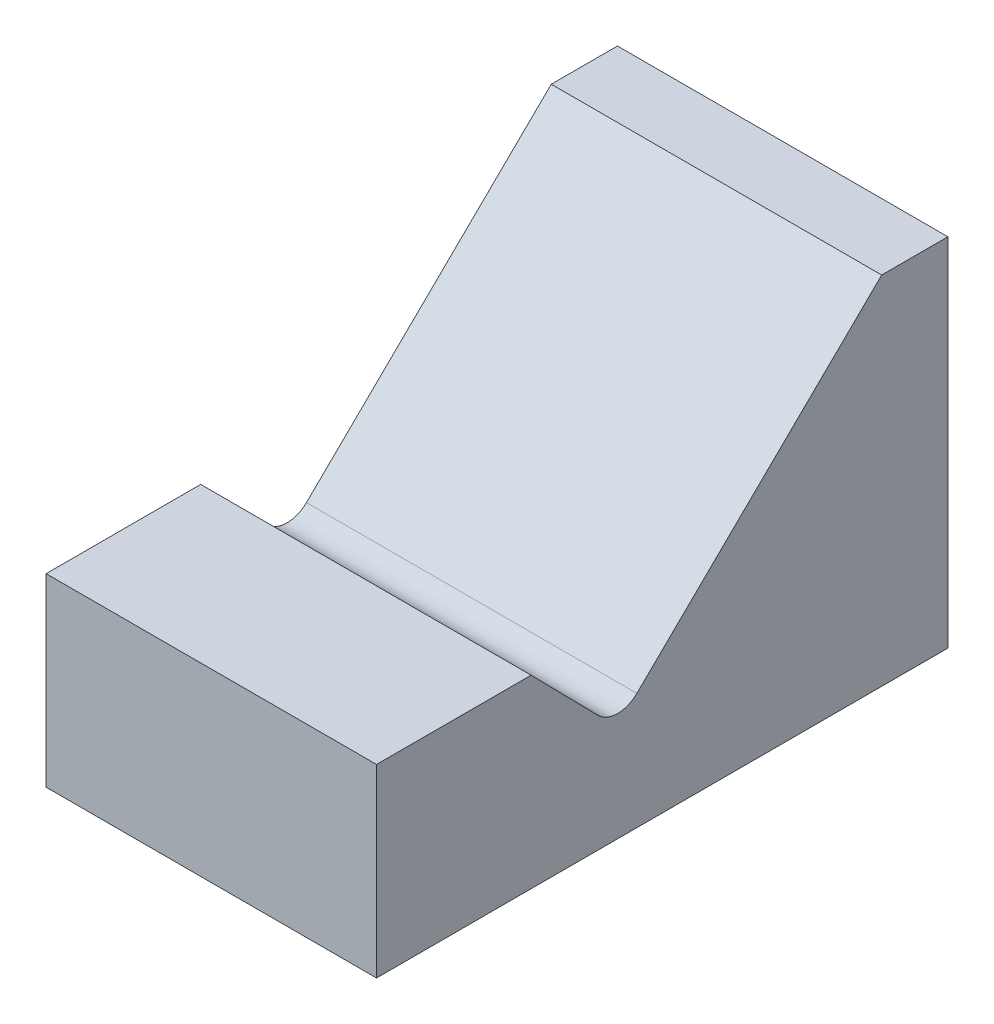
ISO-10303-21;
HEADER;
FILE_DESCRIPTION(('STEP AP214'),'2;1');
FILE_NAME('part.step','',(''),(''),'','','');
FILE_SCHEMA(('AUTOMOTIVE_DESIGN { 1 0 10303 214 1 1 1 1 }'));
ENDSEC;
DATA;
#1=APPLICATION_CONTEXT('core data for automotive mechanical design processes');
#2=APPLICATION_PROTOCOL_DEFINITION('international standard','automotive_design',2000,#1);
#3=PRODUCT_CONTEXT('',#1,'mechanical');
#4=PRODUCT('Part','Part','',(#3));
#5=PRODUCT_RELATED_PRODUCT_CATEGORY('part','',(#4));
#6=PRODUCT_DEFINITION_FORMATION('','',#4);
#7=PRODUCT_DEFINITION_CONTEXT('part definition',#1,'design');
#8=PRODUCT_DEFINITION('design','',#6,#7);
#9=PRODUCT_DEFINITION_SHAPE('','',#8);
#10=(LENGTH_UNIT() NAMED_UNIT(*) SI_UNIT(.MILLI.,.METRE.));
#11=(NAMED_UNIT(*) PLANE_ANGLE_UNIT() SI_UNIT($,.RADIAN.));
#12=(NAMED_UNIT(*) SI_UNIT($,.STERADIAN.) SOLID_ANGLE_UNIT());
#13=UNCERTAINTY_MEASURE_WITH_UNIT(LENGTH_MEASURE(1.E-05),#10,'distance_accuracy_value','');
#14=(GEOMETRIC_REPRESENTATION_CONTEXT(3) GLOBAL_UNCERTAINTY_ASSIGNED_CONTEXT((#13)) GLOBAL_UNIT_ASSIGNED_CONTEXT((#10,
#11,#12)) REPRESENTATION_CONTEXT('',''));
#15=CARTESIAN_POINT('',(0.,0.,0.));
#16=DIRECTION('',(0.,0.,1.));
#17=DIRECTION('',(1.,0.,0.));
#18=AXIS2_PLACEMENT_3D('',#15,#16,#17);
#19=CARTESIAN_POINT('',(76.2,-16.8888549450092,152.326220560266));
#20=DIRECTION('',(-1.,0.,0.));
#21=DIRECTION('',(0.,0.,1.));
#22=AXIS2_PLACEMENT_3D('',#19,#20,#21);
#23=CYLINDRICAL_SURFACE('',#22,12.7);
#24=CARTESIAN_POINT('',(-76.2,-16.8888549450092,152.326220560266));
#25=DIRECTION('',(1.,0.,0.));
#26=DIRECTION('',(0.,0.,-1.));
#27=AXIS2_PLACEMENT_3D('',#24,#25,#26);
#28=CIRCLE('',#27,12.7);
#29=CARTESIAN_POINT('',(-76.2,-25.7772305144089,161.397426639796));
#30=VERTEX_POINT('',#29);
#31=CARTESIAN_POINT('',(-76.2,-25.9600610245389,143.437844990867));
#32=VERTEX_POINT('',#31);
#33=EDGE_CURVE('E139',#30,#32,#28,.T.);
#34=ORIENTED_EDGE('',*,*,#33,.F.);
#35=DIRECTION('',(-1.,0.,0.));
#36=VECTOR('',#35,1.);
#37=CARTESIAN_POINT('',(76.2,-25.7772305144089,161.397426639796));
#38=LINE('',#37,#36);
#39=CARTESIAN_POINT('',(76.2,-25.7772305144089,161.397426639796));
#40=VERTEX_POINT('',#39);
#41=EDGE_CURVE('E12',#40,#30,#38,.T.);
#42=ORIENTED_EDGE('',*,*,#41,.F.);
#43=CARTESIAN_POINT('',(76.2,-16.8888549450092,152.326220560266));
#44=DIRECTION('',(1.,0.,0.));
#45=DIRECTION('',(0.,0.,-1.));
#46=AXIS2_PLACEMENT_3D('',#43,#44,#45);
#47=CIRCLE('',#46,12.7);
#48=CARTESIAN_POINT('',(76.2,-25.9600610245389,143.437844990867));
#49=VERTEX_POINT('',#48);
#50=EDGE_CURVE('E157',#40,#49,#47,.T.);
#51=ORIENTED_EDGE('',*,*,#50,.T.);
#52=DIRECTION('',(-1.,0.,0.));
#53=VECTOR('',#52,1.);
#54=CARTESIAN_POINT('',(76.2,-25.9600610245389,143.437844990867));
#55=LINE('',#54,#53);
#56=EDGE_CURVE('E42',#49,#32,#55,.T.);
#57=ORIENTED_EDGE('',*,*,#56,.T.);
#58=EDGE_LOOP('',(#34,#42,#51,#57));
#59=FACE_BOUND('',#58,.T.);
#60=ADVANCED_FACE('F39',(#59),#23,.F.);
#61=CARTESIAN_POINT('',(76.2,-25.7772305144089,161.397426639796));
#62=DIRECTION('',(0.,-0.699872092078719,0.714268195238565));
#63=DIRECTION('',(0.,-0.714268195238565,-0.699872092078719));
#64=AXIS2_PLACEMENT_3D('',#61,#62,#63);
#65=PLANE('',#64);
#66=DIRECTION('',(0.,0.714268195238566,0.699872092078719));
#67=VECTOR('',#66,1.);
#68=CARTESIAN_POINT('',(-76.2,-25.7772305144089,161.397426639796));
#69=LINE('',#68,#67);
#70=CARTESIAN_POINT('',(-76.2,5.6762399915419,192.216951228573));
#71=VERTEX_POINT('',#70);
#72=EDGE_CURVE('E85',#30,#71,#69,.T.);
#73=ORIENTED_EDGE('',*,*,#72,.T.);
#74=DIRECTION('',(-1.,0.,0.));
#75=VECTOR('',#74,1.);
#76=CARTESIAN_POINT('',(76.2,5.6762399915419,192.216951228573));
#77=LINE('',#76,#75);
#78=CARTESIAN_POINT('',(76.2,5.6762399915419,192.216951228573));
#79=VERTEX_POINT('',#78);
#80=EDGE_CURVE('E49',#79,#71,#77,.T.);
#81=ORIENTED_EDGE('',*,*,#80,.F.);
#82=DIRECTION('',(0.,0.714268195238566,0.699872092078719));
#83=VECTOR('',#82,1.);
#84=CARTESIAN_POINT('',(76.2,-25.7772305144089,161.397426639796));
#85=LINE('',#84,#83);
#86=EDGE_CURVE('E117',#40,#79,#85,.T.);
#87=ORIENTED_EDGE('',*,*,#86,.F.);
#88=ORIENTED_EDGE('',*,*,#41,.T.);
#89=EDGE_LOOP('',(#73,#81,#87,#88));
#90=FACE_BOUND('',#89,.T.);
#91=ADVANCED_FACE('F202',(#90),#65,.F.);
#92=CARTESIAN_POINT('',(76.2,5.6762399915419,192.216951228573));
#93=DIRECTION('',(0.,-1.,0.));
#94=DIRECTION('',(0.,0.,-1.));
#95=AXIS2_PLACEMENT_3D('',#92,#93,#94);
#96=PLANE('',#95);
#97=DIRECTION('',(0.,0.,1.));
#98=VECTOR('',#97,1.);
#99=CARTESIAN_POINT('',(-76.2,5.6762399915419,192.216951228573));
#100=LINE('',#99,#98);
#101=CARTESIAN_POINT('',(-76.2,5.67623999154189,263.514555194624));
#102=VERTEX_POINT('',#101);
#103=EDGE_CURVE('E124',#71,#102,#100,.T.);
#104=ORIENTED_EDGE('',*,*,#103,.T.);
#105=DIRECTION('',(-1.,0.,0.));
#106=VECTOR('',#105,1.);
#107=CARTESIAN_POINT('',(76.2,5.67623999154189,263.514555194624));
#108=LINE('',#107,#106);
#109=CARTESIAN_POINT('',(76.2,5.67623999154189,263.514555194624));
#110=VERTEX_POINT('',#109);
#111=EDGE_CURVE('E121',#110,#102,#108,.T.);
#112=ORIENTED_EDGE('',*,*,#111,.F.);
#113=DIRECTION('',(0.,0.,1.));
#114=VECTOR('',#113,1.);
#115=CARTESIAN_POINT('',(76.2,5.6762399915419,192.216951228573));
#116=LINE('',#115,#114);
#117=EDGE_CURVE('E109',#79,#110,#116,.T.);
#118=ORIENTED_EDGE('',*,*,#117,.F.);
#119=ORIENTED_EDGE('',*,*,#80,.T.);
#120=EDGE_LOOP('',(#104,#112,#118,#119));
#121=FACE_BOUND('',#120,.T.);
#122=ADVANCED_FACE('F122',(#121),#96,.F.);
#123=CARTESIAN_POINT('',(76.2,5.67623999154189,263.514555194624));
#124=DIRECTION('',(0.,0.,-1.));
#125=DIRECTION('',(-1.,0.,0.));
#126=AXIS2_PLACEMENT_3D('',#123,#124,#125);
#127=PLANE('',#126);
#128=DIRECTION('',(0.,-1.,0.));
#129=VECTOR('',#128,1.);
#130=CARTESIAN_POINT('',(-76.2,5.67623999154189,263.514555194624));
#131=LINE('',#130,#129);
#132=CARTESIAN_POINT('',(-76.2,-79.6201539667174,263.514555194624));
#133=VERTEX_POINT('',#132);
#134=EDGE_CURVE('E154',#102,#133,#131,.T.);
#135=ORIENTED_EDGE('',*,*,#134,.T.);
#136=DIRECTION('',(-1.,0.,0.));
#137=VECTOR('',#136,1.);
#138=CARTESIAN_POINT('',(76.2,-79.6201539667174,263.514555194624));
#139=LINE('',#138,#137);
#140=CARTESIAN_POINT('',(76.2,-79.6201539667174,263.514555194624));
#141=VERTEX_POINT('',#140);
#142=EDGE_CURVE('E128',#141,#133,#139,.T.);
#143=ORIENTED_EDGE('',*,*,#142,.F.);
#144=DIRECTION('',(0.,-1.,0.));
#145=VECTOR('',#144,1.);
#146=CARTESIAN_POINT('',(76.2,5.67623999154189,263.514555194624));
#147=LINE('',#146,#145);
#148=EDGE_CURVE('E115',#110,#141,#147,.T.);
#149=ORIENTED_EDGE('',*,*,#148,.F.);
#150=ORIENTED_EDGE('',*,*,#111,.T.);
#151=EDGE_LOOP('',(#135,#143,#149,#150));
#152=FACE_BOUND('',#151,.T.);
#153=ADVANCED_FACE('F130',(#152),#127,.F.);
#154=CARTESIAN_POINT('',(76.2,-79.6201539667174,0.));
#155=DIRECTION('',(0.,-1.,0.));
#156=DIRECTION('',(0.,0.,-1.));
#157=AXIS2_PLACEMENT_3D('',#154,#155,#156);
#158=PLANE('',#157);
#159=DIRECTION('',(0.,0.,1.));
#160=VECTOR('',#159,1.);
#161=CARTESIAN_POINT('',(-76.2,-79.6201539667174,0.));
#162=LINE('',#161,#160);
#163=CARTESIAN_POINT('',(-76.2,-79.6201539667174,0.));
#164=VERTEX_POINT('',#163);
#165=EDGE_CURVE('E151',#164,#133,#162,.T.);
#166=ORIENTED_EDGE('',*,*,#165,.F.);
#167=DIRECTION('',(-1.,0.,0.));
#168=VECTOR('',#167,1.);
#169=CARTESIAN_POINT('',(76.2,-79.6201539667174,0.));
#170=LINE('',#169,#168);
#171=CARTESIAN_POINT('',(76.2,-79.6201539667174,0.));
#172=VERTEX_POINT('',#171);
#173=EDGE_CURVE('E178',#172,#164,#170,.T.);
#174=ORIENTED_EDGE('',*,*,#173,.F.);
#175=DIRECTION('',(0.,0.,1.));
#176=VECTOR('',#175,1.);
#177=CARTESIAN_POINT('',(76.2,-79.6201539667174,0.));
#178=LINE('',#177,#176);
#179=EDGE_CURVE('E132',#172,#141,#178,.T.);
#180=ORIENTED_EDGE('',*,*,#179,.T.);
#181=ORIENTED_EDGE('',*,*,#142,.T.);
#182=EDGE_LOOP('',(#166,#174,#180,#181));
#183=FACE_BOUND('',#182,.T.);
#184=ADVANCED_FACE('F190',(#183),#158,.T.);
#185=CARTESIAN_POINT('',(76.2,84.6719154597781,0.));
#186=DIRECTION('',(0.,0.,-1.));
#187=DIRECTION('',(-1.,0.,0.));
#188=AXIS2_PLACEMENT_3D('',#185,#186,#187);
#189=PLANE('',#188);
#190=DIRECTION('',(0.,-1.,0.));
#191=VECTOR('',#190,1.);
#192=CARTESIAN_POINT('',(-76.2,84.6719154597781,0.));
#193=LINE('',#192,#191);
#194=CARTESIAN_POINT('',(-76.2,84.6719154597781,0.));
#195=VERTEX_POINT('',#194);
#196=EDGE_CURVE('E148',#195,#164,#193,.T.);
#197=ORIENTED_EDGE('',*,*,#196,.F.);
#198=DIRECTION('',(-1.,0.,0.));
#199=VECTOR('',#198,1.);
#200=CARTESIAN_POINT('',(76.2,84.6719154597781,0.));
#201=LINE('',#200,#199);
#202=CARTESIAN_POINT('',(76.2,84.6719154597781,0.));
#203=VERTEX_POINT('',#202);
#204=EDGE_CURVE('E180',#203,#195,#201,.T.);
#205=ORIENTED_EDGE('',*,*,#204,.F.);
#206=DIRECTION('',(0.,-1.,0.));
#207=VECTOR('',#206,1.);
#208=CARTESIAN_POINT('',(76.2,84.6719154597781,0.));
#209=LINE('',#208,#207);
#210=EDGE_CURVE('E134',#203,#172,#209,.T.);
#211=ORIENTED_EDGE('',*,*,#210,.T.);
#212=ORIENTED_EDGE('',*,*,#173,.T.);
#213=EDGE_LOOP('',(#197,#205,#211,#212));
#214=FACE_BOUND('',#213,.T.);
#215=ADVANCED_FACE('F177',(#214),#189,.T.);
#216=CARTESIAN_POINT('',(76.2,84.6719154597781,30.5302107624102));
#217=DIRECTION('',(0.,1.,0.));
#218=DIRECTION('',(0.,0.,1.));
#219=AXIS2_PLACEMENT_3D('',#216,#217,#218);
#220=PLANE('',#219);
#221=DIRECTION('',(0.,0.,-1.));
#222=VECTOR('',#221,1.);
#223=CARTESIAN_POINT('',(-76.2,84.6719154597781,30.5302107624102));
#224=LINE('',#223,#222);
#225=CARTESIAN_POINT('',(-76.2,84.6719154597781,30.5302107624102));
#226=VERTEX_POINT('',#225);
#227=EDGE_CURVE('E145',#226,#195,#224,.T.);
#228=ORIENTED_EDGE('',*,*,#227,.F.);
#229=DIRECTION('',(-1.,0.,0.));
#230=VECTOR('',#229,1.);
#231=CARTESIAN_POINT('',(76.2,84.6719154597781,30.5302107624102));
#232=LINE('',#231,#230);
#233=CARTESIAN_POINT('',(76.2,84.6719154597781,30.5302107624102));
#234=VERTEX_POINT('',#233);
#235=EDGE_CURVE('E185',#234,#226,#232,.T.);
#236=ORIENTED_EDGE('',*,*,#235,.F.);
#237=DIRECTION('',(0.,0.,-1.));
#238=VECTOR('',#237,1.);
#239=CARTESIAN_POINT('',(76.2,84.6719154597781,30.5302107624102));
#240=LINE('',#239,#238);
#241=EDGE_CURVE('E171',#234,#203,#240,.T.);
#242=ORIENTED_EDGE('',*,*,#241,.T.);
#243=ORIENTED_EDGE('',*,*,#204,.T.);
#244=EDGE_LOOP('',(#228,#236,#242,#243));
#245=FACE_BOUND('',#244,.T.);
#246=ADVANCED_FACE('F184',(#245),#220,.T.);
#247=CARTESIAN_POINT('',(76.2,-25.9600610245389,143.437844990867));
#248=DIRECTION('',(0.,0.714268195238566,0.699872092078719));
#249=DIRECTION('',(0.,-0.699872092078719,0.714268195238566));
#250=AXIS2_PLACEMENT_3D('',#247,#248,#249);
#251=PLANE('',#250);
#252=DIRECTION('',(0.,0.699872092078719,-0.714268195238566));
#253=VECTOR('',#252,1.);
#254=CARTESIAN_POINT('',(-76.2,-25.9600610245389,143.437844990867));
#255=LINE('',#254,#253);
#256=EDGE_CURVE('E142',#32,#226,#255,.T.);
#257=ORIENTED_EDGE('',*,*,#256,.F.);
#258=ORIENTED_EDGE('',*,*,#56,.F.);
#259=DIRECTION('',(0.,0.699872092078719,-0.714268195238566));
#260=VECTOR('',#259,1.);
#261=CARTESIAN_POINT('',(76.2,-25.9600610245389,143.437844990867));
#262=LINE('',#261,#260);
#263=EDGE_CURVE('E168',#49,#234,#262,.T.);
#264=ORIENTED_EDGE('',*,*,#263,.T.);
#265=ORIENTED_EDGE('',*,*,#235,.T.);
#266=EDGE_LOOP('',(#257,#258,#264,#265));
#267=FACE_BOUND('',#266,.T.);
#268=ADVANCED_FACE('F193',(#267),#251,.T.);
#269=CARTESIAN_POINT('',(76.2,-16.8888549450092,152.326220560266));
#270=DIRECTION('',(1.,0.,0.));
#271=DIRECTION('',(0.,0.,-1.));
#272=AXIS2_PLACEMENT_3D('',#269,#270,#271);
#273=PLANE('',#272);
#274=ORIENTED_EDGE('',*,*,#50,.F.);
#275=ORIENTED_EDGE('',*,*,#86,.T.);
#276=ORIENTED_EDGE('',*,*,#117,.T.);
#277=ORIENTED_EDGE('',*,*,#148,.T.);
#278=ORIENTED_EDGE('',*,*,#179,.F.);
#279=ORIENTED_EDGE('',*,*,#210,.F.);
#280=ORIENTED_EDGE('',*,*,#241,.F.);
#281=ORIENTED_EDGE('',*,*,#263,.F.);
#282=EDGE_LOOP('',(#274,#275,#276,#277,#278,#279,#280,#281));
#283=FACE_BOUND('',#282,.T.);
#284=ADVANCED_FACE('F112',(#283),#273,.T.);
#285=CARTESIAN_POINT('',(-76.2,-16.8888549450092,152.326220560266));
#286=DIRECTION('',(1.,0.,0.));
#287=DIRECTION('',(0.,0.,-1.));
#288=AXIS2_PLACEMENT_3D('',#285,#286,#287);
#289=PLANE('',#288);
#290=ORIENTED_EDGE('',*,*,#33,.T.);
#291=ORIENTED_EDGE('',*,*,#256,.T.);
#292=ORIENTED_EDGE('',*,*,#227,.T.);
#293=ORIENTED_EDGE('',*,*,#196,.T.);
#294=ORIENTED_EDGE('',*,*,#165,.T.);
#295=ORIENTED_EDGE('',*,*,#134,.F.);
#296=ORIENTED_EDGE('',*,*,#103,.F.);
#297=ORIENTED_EDGE('',*,*,#72,.F.);
#298=EDGE_LOOP('',(#290,#291,#292,#293,#294,#295,#296,#297));
#299=FACE_BOUND('',#298,.T.);
#300=ADVANCED_FACE('F192',(#299),#289,.F.);
#301=CLOSED_SHELL('',(#60,#91,#122,#153,#184,#215,#246,#268,#284,#300));
#302=MANIFOLD_SOLID_BREP('B2',#301);
#303=ADVANCED_BREP_SHAPE_REPRESENTATION('',(#18,#302),#14);
#304=SHAPE_DEFINITION_REPRESENTATION(#9,#303);
ENDSEC;
END-ISO-10303-21;
